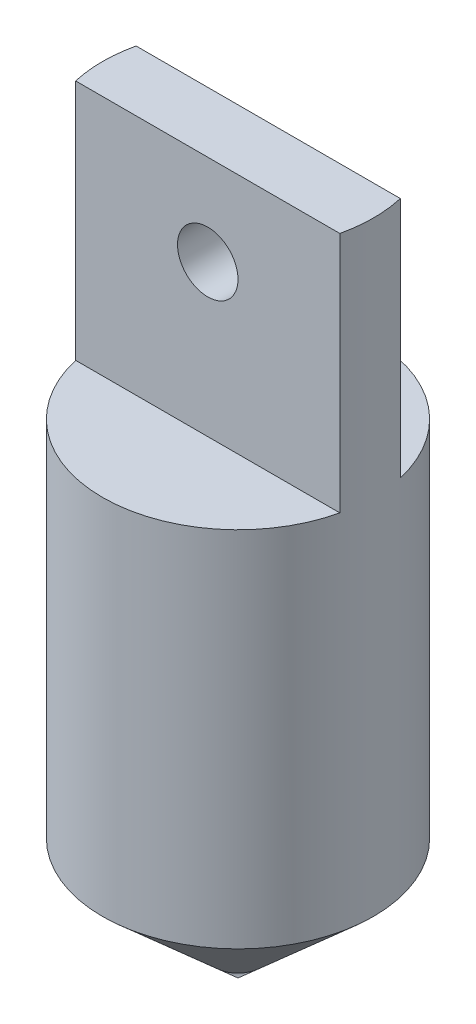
ISO-10303-21;
HEADER;
FILE_DESCRIPTION(('STEP AP214'),'2;1');
FILE_NAME('part.step','',(''),(''),'','','');
FILE_SCHEMA(('AUTOMOTIVE_DESIGN { 1 0 10303 214 1 1 1 1 }'));
ENDSEC;
DATA;
#1=APPLICATION_CONTEXT('core data for automotive mechanical design processes');
#2=APPLICATION_PROTOCOL_DEFINITION('international standard','automotive_design',2000,#1);
#3=PRODUCT_CONTEXT('',#1,'mechanical');
#4=PRODUCT('Part','Part','',(#3));
#5=PRODUCT_RELATED_PRODUCT_CATEGORY('part','',(#4));
#6=PRODUCT_DEFINITION_FORMATION('','',#4);
#7=PRODUCT_DEFINITION_CONTEXT('part definition',#1,'design');
#8=PRODUCT_DEFINITION('design','',#6,#7);
#9=PRODUCT_DEFINITION_SHAPE('','',#8);
#10=(LENGTH_UNIT() NAMED_UNIT(*) SI_UNIT(.MILLI.,.METRE.));
#11=(NAMED_UNIT(*) PLANE_ANGLE_UNIT() SI_UNIT($,.RADIAN.));
#12=(NAMED_UNIT(*) SI_UNIT($,.STERADIAN.) SOLID_ANGLE_UNIT());
#13=UNCERTAINTY_MEASURE_WITH_UNIT(LENGTH_MEASURE(1.E-05),#10,'distance_accuracy_value','');
#14=(GEOMETRIC_REPRESENTATION_CONTEXT(3) GLOBAL_UNCERTAINTY_ASSIGNED_CONTEXT((#13)) GLOBAL_UNIT_ASSIGNED_CONTEXT((#10,
#11,#12)) REPRESENTATION_CONTEXT('',''));
#15=CARTESIAN_POINT('',(0.,0.,0.));
#16=DIRECTION('',(0.,0.,1.));
#17=DIRECTION('',(1.,0.,0.));
#18=AXIS2_PLACEMENT_3D('',#15,#16,#17);
#19=CARTESIAN_POINT('',(0.,60.,0.));
#20=DIRECTION('',(0.,1.,0.));
#21=DIRECTION('',(-1.,0.,0.));
#22=AXIS2_PLACEMENT_3D('',#19,#20,#21);
#23=CYLINDRICAL_SURFACE('',#22,22.4002358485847);
#24=CARTESIAN_POINT('',(0.,-40.,0.));
#25=DIRECTION('',(0.,1.,0.));
#26=DIRECTION('',(-1.,0.,0.));
#27=AXIS2_PLACEMENT_3D('',#24,#25,#26);
#28=CIRCLE('',#27,22.4002358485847);
#29=CARTESIAN_POINT('',(-22.4002358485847,-40.,0.));
#30=VERTEX_POINT('',#29);
#31=EDGE_CURVE('E117',#30,#30,#28,.T.);
#32=ORIENTED_EDGE('',*,*,#31,.T.);
#33=EDGE_LOOP('',(#32));
#34=FACE_BOUND('',#33,.T.);
#35=CARTESIAN_POINT('',(0.,20.,0.));
#36=DIRECTION('',(0.,1.,0.));
#37=DIRECTION('',(0.,0.,1.));
#38=AXIS2_PLACEMENT_3D('',#35,#36,#37);
#39=CIRCLE('',#38,22.4002358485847);
#40=CARTESIAN_POINT('',(-21.83507650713,20.,5.));
#41=VERTEX_POINT('',#40);
#42=CARTESIAN_POINT('',(21.83507650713,20.,5.));
#43=VERTEX_POINT('',#42);
#44=EDGE_CURVE('E12',#41,#43,#39,.T.);
#45=ORIENTED_EDGE('',*,*,#44,.F.);
#46=DIRECTION('',(0.,1.,0.));
#47=VECTOR('',#46,1.);
#48=CARTESIAN_POINT('',(-21.83507650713,60.,5.));
#49=LINE('',#48,#47);
#50=CARTESIAN_POINT('',(-21.83507650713,60.,5.));
#51=VERTEX_POINT('',#50);
#52=EDGE_CURVE('E101',#41,#51,#49,.T.);
#53=ORIENTED_EDGE('',*,*,#52,.T.);
#54=CARTESIAN_POINT('',(0.,60.,0.));
#55=DIRECTION('',(0.,1.,0.));
#56=DIRECTION('',(-1.,0.,0.));
#57=AXIS2_PLACEMENT_3D('',#54,#55,#56);
#58=CIRCLE('',#57,22.4002358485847);
#59=CARTESIAN_POINT('',(-21.83507650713,60.,-5.));
#60=VERTEX_POINT('',#59);
#61=EDGE_CURVE('E110',#60,#51,#58,.T.);
#62=ORIENTED_EDGE('',*,*,#61,.F.);
#63=DIRECTION('',(0.,1.,0.));
#64=VECTOR('',#63,1.);
#65=CARTESIAN_POINT('',(-21.83507650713,60.,-5.));
#66=LINE('',#65,#64);
#67=CARTESIAN_POINT('',(-21.83507650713,20.,-5.));
#68=VERTEX_POINT('',#67);
#69=EDGE_CURVE('E77',#60,#68,#66,.F.);
#70=ORIENTED_EDGE('',*,*,#69,.T.);
#71=CARTESIAN_POINT('',(0.,20.,0.));
#72=DIRECTION('',(0.,-1.,0.));
#73=DIRECTION('',(0.,0.,-1.));
#74=AXIS2_PLACEMENT_3D('',#71,#72,#73);
#75=CIRCLE('',#74,22.4002358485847);
#76=CARTESIAN_POINT('',(21.83507650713,20.,-5.));
#77=VERTEX_POINT('',#76);
#78=EDGE_CURVE('E107',#68,#77,#75,.T.);
#79=ORIENTED_EDGE('',*,*,#78,.T.);
#80=DIRECTION('',(0.,1.,0.));
#81=VECTOR('',#80,1.);
#82=CARTESIAN_POINT('',(21.83507650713,60.,-5.));
#83=LINE('',#82,#81);
#84=CARTESIAN_POINT('',(21.83507650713,60.,-5.));
#85=VERTEX_POINT('',#84);
#86=EDGE_CURVE('E124',#77,#85,#83,.T.);
#87=ORIENTED_EDGE('',*,*,#86,.T.);
#88=CARTESIAN_POINT('',(21.83507650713,60.,5.));
#89=VERTEX_POINT('',#88);
#90=EDGE_CURVE('E118',#89,#85,#58,.T.);
#91=ORIENTED_EDGE('',*,*,#90,.F.);
#92=DIRECTION('',(0.,1.,0.));
#93=VECTOR('',#92,1.);
#94=CARTESIAN_POINT('',(21.83507650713,60.,5.));
#95=LINE('',#94,#93);
#96=EDGE_CURVE('E69',#89,#43,#95,.F.);
#97=ORIENTED_EDGE('',*,*,#96,.T.);
#98=EDGE_LOOP('',(#45,#53,#62,#70,#79,#87,#91,#97));
#99=FACE_BOUND('',#98,.T.);
#100=ADVANCED_FACE('F52',(#34,#99),#23,.T.);
#101=CARTESIAN_POINT('',(0.,-60.,0.));
#102=DIRECTION('',(0.,1.,0.));
#103=DIRECTION('',(-1.,0.,0.));
#104=AXIS2_PLACEMENT_3D('',#101,#102,#103);
#105=CONICAL_SURFACE('',#104,0.,0.841946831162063);
#106=ORIENTED_EDGE('',*,*,#31,.F.);
#107=EDGE_LOOP('',(#106));
#108=FACE_BOUND('',#107,.T.);
#109=CARTESIAN_POINT('',(0.,-60.,0.));
#110=VERTEX_POINT('',#109);
#111=VERTEX_LOOP('',#110);
#112=FACE_BOUND('',#111,.T.);
#113=ADVANCED_FACE('F54',(#108,#112),#105,.T.);
#114=CARTESIAN_POINT('',(0.,60.,0.));
#115=DIRECTION('',(0.,-1.,0.));
#116=DIRECTION('',(1.,0.,0.));
#117=AXIS2_PLACEMENT_3D('',#114,#115,#116);
#118=PLANE('',#117);
#119=ORIENTED_EDGE('',*,*,#61,.T.);
#120=DIRECTION('',(1.,0.,0.));
#121=VECTOR('',#120,1.);
#122=CARTESIAN_POINT('',(0.,60.,5.));
#123=LINE('',#122,#121);
#124=EDGE_CURVE('E62',#51,#89,#123,.T.);
#125=ORIENTED_EDGE('',*,*,#124,.T.);
#126=ORIENTED_EDGE('',*,*,#90,.T.);
#127=DIRECTION('',(-1.,0.,0.));
#128=VECTOR('',#127,1.);
#129=CARTESIAN_POINT('',(0.,60.,-5.));
#130=LINE('',#129,#128);
#131=EDGE_CURVE('E115',#85,#60,#130,.T.);
#132=ORIENTED_EDGE('',*,*,#131,.T.);
#133=EDGE_LOOP('',(#119,#125,#126,#132));
#134=FACE_BOUND('',#133,.T.);
#135=ADVANCED_FACE('F114',(#134),#118,.F.);
#136=CARTESIAN_POINT('',(-22.4002358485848,20.,-22.4002358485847));
#137=DIRECTION('',(0.,-1.,0.));
#138=DIRECTION('',(0.,0.,-1.));
#139=AXIS2_PLACEMENT_3D('',#136,#137,#138);
#140=PLANE('',#139);
#141=ORIENTED_EDGE('',*,*,#78,.F.);
#142=DIRECTION('',(1.,0.,0.));
#143=VECTOR('',#142,1.);
#144=CARTESIAN_POINT('',(-22.4002358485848,20.,-5.));
#145=LINE('',#144,#143);
#146=EDGE_CURVE('E112',#68,#77,#145,.T.);
#147=ORIENTED_EDGE('',*,*,#146,.T.);
#148=EDGE_LOOP('',(#141,#147));
#149=FACE_BOUND('',#148,.T.);
#150=ADVANCED_FACE('F172',(#149),#140,.F.);
#151=CARTESIAN_POINT('',(0.,0.,-5.));
#152=DIRECTION('',(0.,0.,1.));
#153=DIRECTION('',(1.,0.,0.));
#154=AXIS2_PLACEMENT_3D('',#151,#152,#153);
#155=PLANE('',#154);
#156=CARTESIAN_POINT('',(0.,45.,-5.));
#157=DIRECTION('',(0.,0.,1.));
#158=DIRECTION('',(1.,0.,0.));
#159=AXIS2_PLACEMENT_3D('',#156,#157,#158);
#160=CIRCLE('',#159,5.);
#161=CARTESIAN_POINT('',(5.,45.,-5.));
#162=VERTEX_POINT('',#161);
#163=EDGE_CURVE('E139',#162,#162,#160,.T.);
#164=ORIENTED_EDGE('',*,*,#163,.T.);
#165=EDGE_LOOP('',(#164));
#166=FACE_BOUND('',#165,.T.);
#167=ORIENTED_EDGE('',*,*,#146,.F.);
#168=ORIENTED_EDGE('',*,*,#69,.F.);
#169=ORIENTED_EDGE('',*,*,#131,.F.);
#170=ORIENTED_EDGE('',*,*,#86,.F.);
#171=EDGE_LOOP('',(#167,#168,#169,#170));
#172=FACE_BOUND('',#171,.T.);
#173=ADVANCED_FACE('F170',(#166,#172),#155,.F.);
#174=CARTESIAN_POINT('',(-22.4002358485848,20.,22.4002358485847));
#175=DIRECTION('',(0.,1.,0.));
#176=DIRECTION('',(0.,0.,1.));
#177=AXIS2_PLACEMENT_3D('',#174,#175,#176);
#178=PLANE('',#177);
#179=ORIENTED_EDGE('',*,*,#44,.T.);
#180=DIRECTION('',(1.,0.,0.));
#181=VECTOR('',#180,1.);
#182=CARTESIAN_POINT('',(-22.4002358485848,20.,5.));
#183=LINE('',#182,#181);
#184=EDGE_CURVE('E144',#41,#43,#183,.T.);
#185=ORIENTED_EDGE('',*,*,#184,.F.);
#186=EDGE_LOOP('',(#179,#185));
#187=FACE_BOUND('',#186,.T.);
#188=ADVANCED_FACE('F179',(#187),#178,.T.);
#189=CARTESIAN_POINT('',(0.,0.,5.));
#190=DIRECTION('',(0.,0.,-1.));
#191=DIRECTION('',(1.,0.,0.));
#192=AXIS2_PLACEMENT_3D('',#189,#190,#191);
#193=PLANE('',#192);
#194=CARTESIAN_POINT('',(0.,45.,5.));
#195=DIRECTION('',(0.,0.,1.));
#196=DIRECTION('',(1.,0.,0.));
#197=AXIS2_PLACEMENT_3D('',#194,#195,#196);
#198=CIRCLE('',#197,5.);
#199=CARTESIAN_POINT('',(5.,45.,5.));
#200=VERTEX_POINT('',#199);
#201=EDGE_CURVE('E145',#200,#200,#198,.T.);
#202=ORIENTED_EDGE('',*,*,#201,.F.);
#203=EDGE_LOOP('',(#202));
#204=FACE_BOUND('',#203,.T.);
#205=ORIENTED_EDGE('',*,*,#184,.T.);
#206=ORIENTED_EDGE('',*,*,#96,.F.);
#207=ORIENTED_EDGE('',*,*,#124,.F.);
#208=ORIENTED_EDGE('',*,*,#52,.F.);
#209=EDGE_LOOP('',(#205,#206,#207,#208));
#210=FACE_BOUND('',#209,.T.);
#211=ADVANCED_FACE('F100',(#204,#210),#193,.F.);
#212=CARTESIAN_POINT('',(0.,45.,-22.4002358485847));
#213=DIRECTION('',(0.,0.,1.));
#214=DIRECTION('',(1.,0.,0.));
#215=AXIS2_PLACEMENT_3D('',#212,#213,#214);
#216=CYLINDRICAL_SURFACE('',#215,5.);
#217=ORIENTED_EDGE('',*,*,#201,.T.);
#218=EDGE_LOOP('',(#217));
#219=FACE_BOUND('',#218,.T.);
#220=ORIENTED_EDGE('',*,*,#163,.F.);
#221=EDGE_LOOP('',(#220));
#222=FACE_BOUND('',#221,.T.);
#223=ADVANCED_FACE('F224',(#219,#222),#216,.F.);
#224=CLOSED_SHELL('',(#100,#113,#135,#150,#173,#188,#211,#223));
#225=MANIFOLD_SOLID_BREP('B2',#224);
#226=ADVANCED_BREP_SHAPE_REPRESENTATION('',(#18,#225),#14);
#227=SHAPE_DEFINITION_REPRESENTATION(#9,#226);
ENDSEC;
END-ISO-10303-21;
